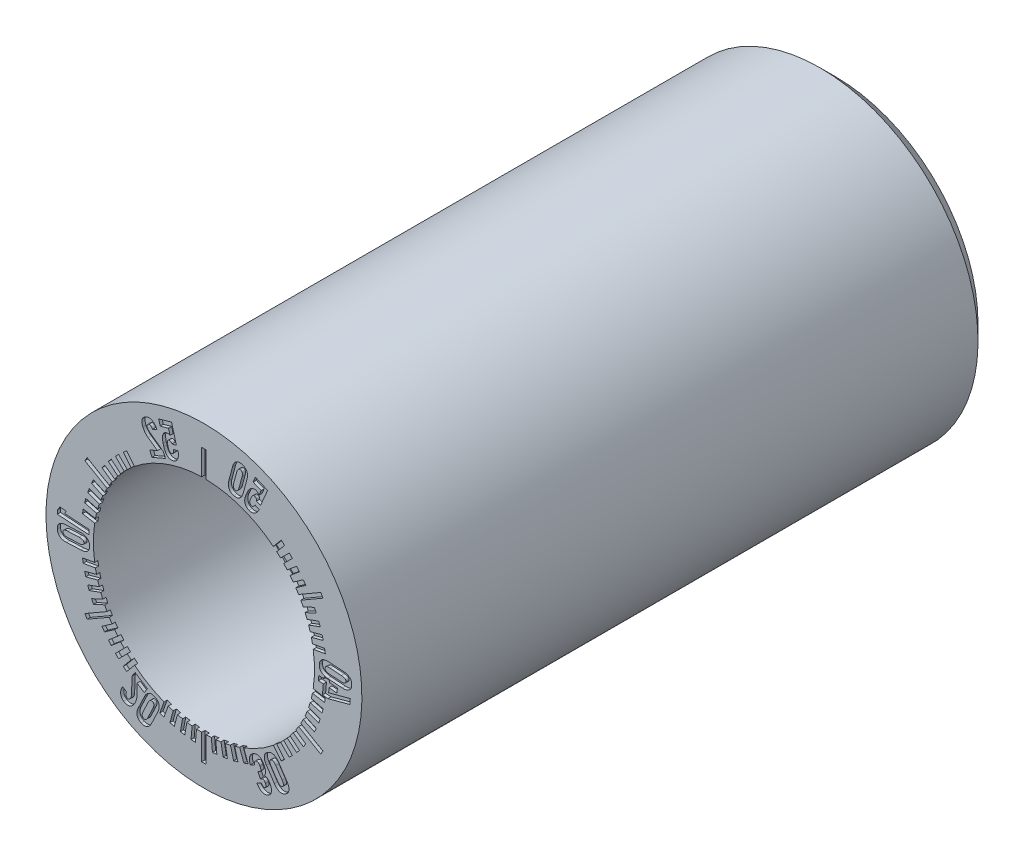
from build123d import *

# Parameters (mm, degrees)
CUT_EXTRUDE1_START = -0.1
CUT_EXTRUDE1_DEPTH = 0.1


with BuildPart() as part:
    # Sketch1 → Revolve1 (revolve)
    with BuildSketch(Plane(origin=(0, 0, 0), x_dir=(0, 0, -1), z_dir=(1, 0, 0))):
        Polygon((20, 2.5), (20, 4.5), (19.5, 5), (0, 5), (0, 3.5), (5, 3.5), (5, 1.25), (15, 1.25), (15, 2.5), align=None)
    revolve(axis=Axis((0, 0, 0), (0, 0, 1)))

    # Sketch2 → Cut-Extrude1 (cut)
    # profile 1 of 58: a face of its own
    with BuildSketch(Plane.XY.offset(CUT_EXTRUDE1_START)):
        with BuildLine():
            add(Edge.make_bspline(
                [(-0.963398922, 3.491967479), (-0.943691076, 3.497097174), (-0.915713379, 3.509662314), (-0.883270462, 3.534044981), (-0.862017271, 3.556028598), (-0.84399068, 3.581643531), (-0.829628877, 3.610634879), (-0.818540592, 3.642732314), (-0.811073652, 3.677865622), (-0.80742026, 3.715678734), (-0.807382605, 3.770861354), (-0.81426484, 3.812949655), (-0.820176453, 3.841421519)],
                knots=[0, 0, 0, 0, 0.145415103, 0.216818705, 0.289347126, 0.363340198, 0.440075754, 0.520124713, 0.605777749, 0.69649618, 0.791544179, 1, 1, 1, 1], degree=3))
            Line((-0.820176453, 3.841421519), (-0.820314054, 3.842051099))
            Line((-0.820314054, 3.842051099), (-0.963362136, 3.802672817))
            Line((-0.963362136, 3.802672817), (-0.963224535, 3.802043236))
            add(Edge.make_bspline(
                [(-0.963224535, 3.802043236), (-0.960278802, 3.785789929), (-0.957663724, 3.762083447), (-0.96042298, 3.731942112), (-0.965318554, 3.712849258), (-0.973504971, 3.696624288), (-0.987741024, 3.678657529), (-1.003244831, 3.670670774), (-1.013951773, 3.66773284)],
                knots=[0, 0, 0, 0, 0.313109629, 0.447280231, 0.570879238, 0.68353828, 0.788831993, 1, 1, 1, 1], degree=3))
            add(Edge.make_bspline(
                [(-1.013951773, 3.66773284), (-1.025414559, 3.664684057), (-1.043855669, 3.66312308), (-1.0664287, 3.671751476), (-1.08168352, 3.682670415), (-1.095456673, 3.697700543), (-1.112531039, 3.724626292), (-1.120931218, 3.748455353), (-1.125660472, 3.765353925)],
                knots=[0, 0, 0, 0, 0.215343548, 0.318808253, 0.428769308, 0.550080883, 0.683403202, 1, 1, 1, 1], degree=3))
            Line((-1.125660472, 3.765353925), (-1.147851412, 3.846061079))
            add(Edge.make_bspline(
                [(-1.147851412, 3.846061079), (-1.152266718, 3.863008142), (-1.157742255, 3.887527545), (-1.157406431, 3.919028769), (-1.154224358, 3.938502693), (-1.1477516, 3.955115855), (-1.135004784, 3.973214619), (-1.120176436, 3.981163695), (-1.109903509, 3.983911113)],
                knots=[0, 0, 0, 0, 0.330370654, 0.46673551, 0.589796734, 0.699046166, 0.799089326, 1, 1, 1, 1], degree=3))
            add(Edge.make_bspline(
                [(-1.109903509, 3.983911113), (-1.100274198, 3.986514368), (-1.085153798, 3.988413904), (-1.06550986, 3.984596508), (-1.051596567, 3.978891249), (-1.038531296, 3.970619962), (-1.022216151, 3.955545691), (-1.012224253, 3.941581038), (-1.00670531, 3.93126545)],
                knots=[0, 0, 0, 0, 0.238363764, 0.355275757, 0.473080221, 0.594658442, 0.721599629, 1, 1, 1, 1], degree=3))
            Line((-1.00670531, 3.93126545), (-0.872963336, 3.967950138))
            Line((-0.872963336, 3.967950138), (-1.025193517, 4.521705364))
            Line((-1.025193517, 4.521705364), (-1.43303211, 4.409612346))
            Line((-1.43303211, 4.409612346), (-1.384922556, 4.23476422))
            Line((-1.384922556, 4.23476422), (-1.120236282, 4.307654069))
            Line((-1.120236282, 4.307654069), (-1.073369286, 4.137283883))
            add(Edge.make_bspline(
                [(-1.073369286, 4.137283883), (-1.08092465, 4.142295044), (-1.093159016, 4.149210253), (-1.111486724, 4.154129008), (-1.140619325, 4.159596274), (-1.166028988, 4.158089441), (-1.185189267, 4.153017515)],
                knots=[0, 0, 0, 0, 0.235051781, 0.357896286, 0.488415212, 1, 1, 1, 1], degree=3))
            add(Edge.make_bspline(
                [(-1.185189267, 4.153017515), (-1.203816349, 4.148195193), (-1.230023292, 4.136280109), (-1.259350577, 4.112422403), (-1.277445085, 4.090983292), (-1.292213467, 4.06610587), (-1.30288085, 4.037727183), (-1.310243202, 4.006204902), (-1.313562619, 3.971523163), (-1.313489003, 3.933980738), (-1.308120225, 3.87822992), (-1.299073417, 3.835605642), (-1.290899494, 3.806682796)],
                knots=[0, 0, 0, 0, 0.141925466, 0.209430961, 0.277840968, 0.348141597, 0.422141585, 0.500944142, 0.586672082, 0.678948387, 0.777953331, 1, 1, 1, 1], degree=3))
            Line((-1.290899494, 3.806682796), (-1.268708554, 3.725975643))
            add(Edge.make_bspline(
                [(-1.268708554, 3.725975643), (-1.260782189, 3.696989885), (-1.2465533, 3.65563087), (-1.220647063, 3.605576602), (-1.199494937, 3.57384782), (-1.176201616, 3.546482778), (-1.15089635, 3.523855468), (-1.123682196, 3.505730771), (-1.094380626, 3.49284974), (-1.06352741, 3.48459686), (-1.019249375, 3.48082902), (-0.98555523, 3.485777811), (-0.963398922, 3.491967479)],
                knots=[0, 0, 0, 0, 0.207498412, 0.300462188, 0.388251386, 0.470100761, 0.547790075, 0.621801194, 0.694771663, 0.767701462, 0.841218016, 1, 1, 1, 1], degree=3))
        make_face()
    # profile 2 of 58: a face of its own
    with BuildSketch(Plane.XY.offset(CUT_EXTRUDE1_START)):
        with BuildLine():
            Line((-1.217541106, 3.431346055), (-1.284083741, 3.587083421))
            Line((-1.284083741, 3.587083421), (-1.70882716, 3.895073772))
            add(Edge.make_bspline(
                [(-1.70882716, 3.895073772), (-1.727229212, 3.908553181), (-1.759251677, 3.937516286), (-1.783909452, 3.973123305), (-1.791751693, 3.991772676)],
                knots=[0, 0, 0, 0, 0.531264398, 1, 1, 1, 1], degree=3))
            Line((-1.791751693, 3.991772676), (-1.79235425, 3.992912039))
            add(Edge.make_bspline(
                [(-1.79235425, 3.992912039), (-1.797064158, 4.004037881), (-1.802294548, 4.0211074), (-1.801901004, 4.043773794), (-1.798337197, 4.058817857), (-1.791406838, 4.072298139), (-1.777643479, 4.088822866), (-1.762994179, 4.097075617), (-1.75274653, 4.101631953)],
                knots=[0, 0, 0, 0, 0.277150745, 0.39895692, 0.513565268, 0.626865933, 0.741851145, 1, 1, 1, 1], degree=3))
            add(Edge.make_bspline(
                [(-1.75274653, 4.101631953), (-1.742282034, 4.106409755), (-1.724851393, 4.109416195), (-1.701907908, 4.104885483), (-1.685098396, 4.097279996), (-1.66914391, 4.085397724), (-1.647678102, 4.063381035), (-1.634656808, 4.04286721), (-1.62667354, 4.027970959)],
                knots=[0, 0, 0, 0, 0.212932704, 0.317957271, 0.430528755, 0.552792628, 0.685363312, 1, 1, 1, 1], degree=3))
            Line((-1.62667354, 4.027970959), (-1.626372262, 4.027401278))
            Line((-1.626372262, 4.027401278), (-1.486618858, 4.086948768))
            Line((-1.486618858, 4.086948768), (-1.486920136, 4.087518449))
            add(Edge.make_bspline(
                [(-1.486920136, 4.087518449), (-1.499480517, 4.113880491), (-1.521349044, 4.150456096), (-1.555013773, 4.194137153), (-1.581579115, 4.221174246), (-1.609292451, 4.243835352), (-1.637969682, 4.262096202), (-1.667677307, 4.27547321), (-1.698254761, 4.283960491), (-1.729356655, 4.287593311), (-1.771845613, 4.286068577), (-1.802993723, 4.277174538), (-1.822862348, 4.268674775)],
                knots=[0, 0, 0, 0, 0.205728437, 0.299640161, 0.38832332, 0.472436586, 0.551647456, 0.627417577, 0.701370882, 0.774580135, 0.84742633, 1, 1, 1, 1], degree=3))
            add(Edge.make_bspline(
                [(-1.822862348, 4.268674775), (-1.843974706, 4.2598494), (-1.873445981, 4.243491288), (-1.906685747, 4.215059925), (-1.926937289, 4.191852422), (-1.94313093, 4.166392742), (-1.954889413, 4.138748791), (-1.96235234, 4.109163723), (-1.965207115, 4.07771616), (-1.964109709, 4.044681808), (-1.956736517, 3.997039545), (-1.944448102, 3.96172232), (-1.934524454, 3.938210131)],
                knots=[0, 0, 0, 0, 0.173330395, 0.252926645, 0.330174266, 0.405738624, 0.480457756, 0.556707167, 0.635844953, 0.718783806, 0.806449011, 1, 1, 1, 1], degree=3))
            Line((-1.934524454, 3.938210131), (-1.934223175, 3.937640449))
            add(Edge.make_bspline(
                [(-1.934223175, 3.937640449), (-1.925163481, 3.916940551), (-1.910048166, 3.886373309), (-1.884959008, 3.848385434), (-1.864470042, 3.820883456), (-1.842359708, 3.795043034), (-1.811705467, 3.763307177), (-1.786321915, 3.742549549), (-1.768768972, 3.729963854)],
                knots=[0, 0, 0, 0, 0.252454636, 0.379386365, 0.507804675, 0.635109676, 0.758810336, 1, 1, 1, 1], degree=3))
            Line((-1.768768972, 3.729963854), (-1.46908914, 3.520881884))
            Line((-1.46908914, 3.520881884), (-1.716333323, 3.415495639))
            Line((-1.716333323, 3.415495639), (-1.645218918, 3.248908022))
            Line((-1.645218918, 3.248908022), (-1.217541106, 3.431346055))
        make_face()
    # profile 3 of 58: a face of its own
    with BuildSketch(Plane.XY.offset(CUT_EXTRUDE1_START)):
        with BuildLine():
            Line((0.906376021, 4.269673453), (0.788776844, 3.831770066))
            add(Edge.make_bspline(
                [(0.788776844, 3.831770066), (0.78310185, 3.811321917), (0.776857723, 3.780912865), (0.772575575, 3.740833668), (0.771830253, 3.712885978), (0.773679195, 3.686257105), (0.777631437, 3.660962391), (0.783810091, 3.636929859), (0.792260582, 3.614237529), (0.803332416, 3.59320405), (0.816312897, 3.573686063), (0.831768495, 3.556189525), (0.849634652, 3.540698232), (0.86948871, 3.526725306), (0.90003518, 3.510512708), (0.925021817, 3.501653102), (0.942441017, 3.496986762)],
                knots=[0, 0, 0, 0, 0.152012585, 0.221947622, 0.288611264, 0.352064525, 0.412958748, 0.471817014, 0.529594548, 0.586042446, 0.641774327, 0.697188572, 0.752748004, 0.810877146, 0.870780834, 1, 1, 1, 1], degree=3))
            add(Edge.make_bspline(
                [(0.942441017, 3.496986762), (0.959956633, 3.49229876), (0.986141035, 3.48713971), (1.020810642, 3.486263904), (1.045098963, 3.488089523), (1.068367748, 3.492917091), (1.090487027, 3.500461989), (1.111667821, 3.510557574), (1.131604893, 3.523486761), (1.15023566, 3.539080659), (1.167846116, 3.55666284), (1.183938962, 3.57671133), (1.198394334, 3.599084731), (1.211842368, 3.623413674), (1.228426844, 3.659827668), (1.237704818, 3.689216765), (1.243280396, 3.709480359)],
                knots=[0, 0, 0, 0, 0.130125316, 0.190042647, 0.248117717, 0.304319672, 0.359876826, 0.415243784, 0.472074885, 0.529686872, 0.589087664, 0.650164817, 0.713550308, 0.779781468, 0.849252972, 1, 1, 1, 1], degree=3))
            Line((1.243280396, 3.709480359), (1.360879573, 4.147383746))
            add(Edge.make_bspline(
                [(1.360879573, 4.147383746), (1.366562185, 4.167832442), (1.372784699, 4.198239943), (1.377099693, 4.238321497), (1.377759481, 4.266225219), (1.376212, 4.292837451), (1.372170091, 4.318082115), (1.36609377, 4.342101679), (1.357398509, 4.364657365), (1.346407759, 4.385671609), (1.333427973, 4.405205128), (1.317856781, 4.422681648), (1.300228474, 4.438476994), (1.280037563, 4.452089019), (1.249815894, 4.468844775), (1.224563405, 4.477379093), (1.2072154, 4.482167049)],
                knots=[0, 0, 0, 0, 0.152021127, 0.221960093, 0.28862748, 0.351812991, 0.412710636, 0.471572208, 0.529046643, 0.585497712, 0.641232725, 0.696650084, 0.752785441, 0.810393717, 0.870773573, 1, 1, 1, 1], degree=3))
            add(Edge.make_bspline(
                [(1.2072154, 4.482167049), (1.189698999, 4.486859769), (1.163516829, 4.492005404), (1.12884381, 4.492901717), (1.104609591, 4.491025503), (1.081402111, 4.486418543), (1.059315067, 4.479056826), (1.038249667, 4.468961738), (1.018395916, 4.456128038), (0.999582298, 4.441021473), (0.982407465, 4.423252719), (0.966106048, 4.403579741), (0.951402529, 4.381323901), (0.938163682, 4.356704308), (0.921688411, 4.319805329), (0.912009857, 4.290207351), (0.906376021, 4.269673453)],
                knots=[0, 0, 0, 0, 0.130052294, 0.189936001, 0.247978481, 0.303825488, 0.358985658, 0.414321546, 0.470687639, 0.527982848, 0.586757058, 0.647395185, 0.710773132, 0.777466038, 0.847431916, 1, 1, 1, 1], degree=3))
        make_face()
        with BuildLine():
            Line((1.205416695, 4.139388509), (1.112703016, 3.794258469))
            add(Edge.make_bspline(
                [(1.112703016, 3.794258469), (1.107090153, 3.773534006), (1.097233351, 3.744676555), (1.078892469, 3.711103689), (1.064471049, 3.692307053), (1.048335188, 3.678217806), (1.023280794, 3.667401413), (1.002499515, 3.667995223), (0.98953412, 3.671834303)],
                knots=[0, 0, 0, 0, 0.330588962, 0.466458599, 0.586759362, 0.693541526, 0.792195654, 1, 1, 1, 1], degree=3))
            add(Edge.make_bspline(
                [(0.98953412, 3.671834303), (0.976337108, 3.67488688), (0.95800071, 3.684837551), (0.941836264, 3.706822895), (0.934934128, 3.727055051), (0.931917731, 3.750546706), (0.932341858, 3.788818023), (0.939343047, 3.818656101), (0.944489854, 3.8393844)],
                knots=[0, 0, 0, 0, 0.207947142, 0.307153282, 0.413252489, 0.533041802, 0.670171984, 1, 1, 1, 1], degree=3))
            Line((0.944489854, 3.8393844), (1.037203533, 4.18451444))
            add(Edge.make_bspline(
                [(1.037203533, 4.18451444), (1.04257628, 4.205329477), (1.052532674, 4.234243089), (1.070858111, 4.267835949), (1.085307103, 4.286630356), (1.101459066, 4.300629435), (1.126431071, 4.311824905), (1.147360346, 4.31059651), (1.16029853, 4.307217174)],
                knots=[0, 0, 0, 0, 0.330542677, 0.467341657, 0.586506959, 0.693198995, 0.792612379, 1, 1, 1, 1], degree=3))
            add(Edge.make_bspline(
                [(1.16029853, 4.307217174), (1.173161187, 4.3036982), (1.192094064, 4.294378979), (1.207801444, 4.271958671), (1.215026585, 4.25180674), (1.217993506, 4.228305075), (1.217334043, 4.190072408), (1.210908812, 4.160151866), (1.205416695, 4.139388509)],
                knots=[0, 0, 0, 0, 0.207474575, 0.307012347, 0.413818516, 0.53349813, 0.669079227, 1, 1, 1, 1], degree=3))
        make_face(mode=Mode.SUBTRACT)
    # profile 4 of 58: a face of its own
    with BuildSketch(Plane.XY.offset(CUT_EXTRUDE1_START)):
        with BuildLine():
            add(Edge.make_bspline(
                [(1.423479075, 3.331326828), (1.442064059, 3.323198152), (1.471533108, 3.315263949), (1.51190905, 3.31413571), (1.542067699, 3.318104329), (1.572043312, 3.326997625), (1.601470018, 3.340354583), (1.629915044, 3.358774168), (1.657726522, 3.381310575), (1.684005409, 3.40870423), (1.718108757, 3.451906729), (1.739447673, 3.488686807), (1.752234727, 3.514717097)],
                knots=[0, 0, 0, 0, 0.145510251, 0.216188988, 0.288744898, 0.362890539, 0.439836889, 0.519872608, 0.605471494, 0.69622534, 0.791727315, 1, 1, 1, 1], degree=3))
            Line((1.752234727, 3.514717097), (1.752395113, 3.515434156))
            Line((1.752395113, 3.515434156), (1.616351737, 3.573721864))
            Line((1.616351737, 3.573721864), (1.61619135, 3.573004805))
            add(Edge.make_bspline(
                [(1.61619135, 3.573004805), (1.608596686, 3.558386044), (1.595770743, 3.538390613), (1.575014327, 3.516376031), (1.559062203, 3.504818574), (1.542742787, 3.49683682), (1.520288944, 3.492415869), (1.503340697, 3.495369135), (1.493171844, 3.499975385)],
                knots=[0, 0, 0, 0, 0.312251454, 0.4475685, 0.571049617, 0.683855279, 0.789242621, 1, 1, 1, 1], degree=3))
            add(Edge.make_bspline(
                [(1.493171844, 3.499975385), (1.482132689, 3.5043996), (1.467185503, 3.514941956), (1.454729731, 3.53547829), (1.449669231, 3.553426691), (1.448210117, 3.573679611), (1.451733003, 3.605221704), (1.459797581, 3.6290532), (1.466624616, 3.645147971)],
                knots=[0, 0, 0, 0, 0.215180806, 0.318297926, 0.428713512, 0.549185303, 0.683343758, 1, 1, 1, 1], degree=3))
            Line((1.466624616, 3.645147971), (1.499646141, 3.72209046))
            add(Edge.make_bspline(
                [(1.499646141, 3.72209046), (1.506712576, 3.738039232), (1.517751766, 3.760497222), (1.537503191, 3.78490344), (1.552144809, 3.798109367), (1.567621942, 3.80699413), (1.588818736, 3.813407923), (1.605406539, 3.810391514), (1.615134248, 3.80624507)],
                knots=[0, 0, 0, 0, 0.329508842, 0.466039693, 0.588877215, 0.698332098, 0.799555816, 1, 1, 1, 1], degree=3))
            add(Edge.make_bspline(
                [(1.615134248, 3.80624507), (1.624473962, 3.802511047), (1.637030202, 3.794087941), (1.650022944, 3.778963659), (1.657339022, 3.765892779), (1.662331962, 3.75136947), (1.666100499, 3.72952273), (1.664563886, 3.712354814), (1.662617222, 3.70081278)],
                knots=[0, 0, 0, 0, 0.239137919, 0.354459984, 0.473242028, 0.594435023, 0.719472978, 1, 1, 1, 1], degree=3))
            Line((1.662617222, 3.70081278), (1.789666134, 3.646332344))
            Line((1.789666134, 3.646332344), (2.01535628, 4.17294585))
            Line((2.01535628, 4.17294585), (1.627641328, 4.339130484))
            Line((1.627641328, 4.339130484), (1.556419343, 4.172966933))
            Line((1.556419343, 4.172966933), (1.808090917, 4.065070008))
            Line((1.808090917, 4.065070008), (1.73868911, 3.902901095))
            add(Edge.make_bspline(
                [(1.73868911, 3.902901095), (1.736301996, 3.911673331), (1.730592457, 3.92438938), (1.719790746, 3.939973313), (1.709815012, 3.951149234), (1.698690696, 3.961526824), (1.683377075, 3.974023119), (1.67028718, 3.9808266), (1.661556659, 3.984789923)],
                knots=[0, 0, 0, 0, 0.234742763, 0.357588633, 0.489557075, 0.621607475, 0.751152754, 1, 1, 1, 1], degree=3))
            add(Edge.make_bspline(
                [(1.661556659, 3.984789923), (1.643921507, 3.992461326), (1.616081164, 3.999793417), (1.578292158, 3.999340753), (1.55087285, 3.993730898), (1.523999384, 3.983383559), (1.497921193, 3.968043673), (1.472853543, 3.947717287), (1.44851478, 3.922855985), (1.425101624, 3.893609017), (1.39452114, 3.846873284), (1.375548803, 3.807788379), (1.363602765, 3.780378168)],
                knots=[0, 0, 0, 0, 0.14245609, 0.209736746, 0.278264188, 0.348619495, 0.422077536, 0.501376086, 0.586938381, 0.679293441, 0.778390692, 1, 1, 1, 1], degree=3))
            Line((1.363602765, 3.780378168), (1.330581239, 3.703435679))
            add(Edge.make_bspline(
                [(1.330581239, 3.703435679), (1.318727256, 3.675953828), (1.304094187, 3.634804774), (1.293367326, 3.579647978), (1.289783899, 3.54168732), (1.291145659, 3.505916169), (1.296602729, 3.4724583), (1.306741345, 3.441485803), (1.321514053, 3.413210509), (1.340673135, 3.387813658), (1.372720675, 3.357193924), (1.402427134, 3.340419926), (1.423479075, 3.331326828)],
                knots=[0, 0, 0, 0, 0.207204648, 0.300560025, 0.388130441, 0.470353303, 0.547509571, 0.621916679, 0.694790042, 0.767181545, 0.841030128, 1, 1, 1, 1], degree=3))
        make_face()
    # profile 5 of 58: a face of its own
    with BuildSketch(Plane.XY.offset(CUT_EXTRUDE1_START)):
        with BuildLine():
            ThreePointArc((-2.302929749, 2.635624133), (-2.249756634, 2.681155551), (-2.195683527, 2.725614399))
            Line((-2.195683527, 2.725614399), (-2.446820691, 3.024908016))
            Line((-2.446820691, 3.024908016), (-2.554066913, 2.934917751))
            Line((-2.554066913, 2.934917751), (-2.302929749, 2.635624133))
        make_face()
    # profile 6 of 58: a face of its own
    with BuildSketch(Plane.XY.offset(CUT_EXTRUDE1_START)):
        with BuildLine():
            ThreePointArc((-2.523876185, 2.424881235), (-2.474873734, 2.474873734), (-2.424881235, 2.523876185))
            Line((-2.424881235, 2.523876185), (-2.701147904, 2.800142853))
            Line((-2.701147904, 2.800142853), (-2.800142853, 2.701147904))
            Line((-2.800142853, 2.701147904), (-2.523876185, 2.424881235))
        make_face()
    # profile 7 of 58: a face of its own
    with BuildSketch(Plane.XY.offset(CUT_EXTRUDE1_START)):
        with BuildLine():
            ThreePointArc((-2.725614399, 2.195683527), (-2.681155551, 2.249756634), (-2.635624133, 2.302929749))
            Line((-2.635624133, 2.302929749), (-2.934917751, 2.554066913))
            Line((-2.934917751, 2.554066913), (-3.024908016, 2.446820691))
            Line((-3.024908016, 2.446820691), (-2.725614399, 2.195683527))
        make_face()
    # profile 8 of 58: a face of its own
    with BuildSketch(Plane.XY.offset(CUT_EXTRUDE1_START)):
        with BuildLine():
            ThreePointArc((-2.906609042, 1.94977534), (-2.867032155, 2.007517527), (-2.826308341, 2.064456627))
            Line((-2.826308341, 2.064456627), (-3.146351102, 2.288552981))
            Line((-3.146351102, 2.288552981), (-3.226651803, 2.173871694))
            Line((-3.226651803, 2.173871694), (-2.906609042, 1.94977534))
        make_face()
    # profile 9 of 58: a face of its own
    with BuildSketch(Plane.XY.offset(CUT_EXTRUDE1_START)):
        with BuildLine():
            ThreePointArc((-3.065482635, 1.689028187), (-3.031088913, 1.75), (-2.995482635, 1.810271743))
            Line((-2.995482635, 1.810271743), (-3.69756949, 2.215621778))
            Line((-3.69756949, 2.215621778), (-3.76756949, 2.094378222))
            Line((-3.76756949, 2.094378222), (-3.065482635, 1.689028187))
        make_face()
    # profile 10 of 58: a face of its own
    with BuildSketch(Plane.XY.offset(CUT_EXTRUDE1_START)):
        with BuildLine():
            ThreePointArc((-3.312207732, 1.13105258), (-3.288924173, 1.197070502), (-3.264324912, 1.262609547))
            Line((-3.264324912, 1.262609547), (-3.631462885, 1.396236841))
            Line((-3.631462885, 1.396236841), (-3.679345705, 1.264679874))
            Line((-3.679345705, 1.264679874), (-3.312207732, 1.13105258))
        make_face()
    # profile 11 of 58: a face of its own
    with BuildSketch(Plane.XY.offset(CUT_EXTRUDE1_START)):
        with BuildLine():
            ThreePointArc((-3.398181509, 0.838070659), (-3.380740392, 0.905866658), (-3.361946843, 0.973300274))
            Line((-3.361946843, 0.973300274), (-3.739334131, 1.074420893))
            Line((-3.739334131, 1.074420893), (-3.775568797, 0.939191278))
            Line((-3.775568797, 0.939191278), (-3.398181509, 0.838070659))
        make_face()
    # profile 12 of 58: a face of its own
    with BuildSketch(Plane.XY.offset(CUT_EXTRUDE1_START)):
        Polygon((-4.631555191, 0.318225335), (-4.639555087, 0.191470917), (-3.639547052, 0.128627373), (-3.630255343, 0.276992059), (-4.408929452, 0.326051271), (-4.356536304, 0.418851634), (-4.556866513, 0.431420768), align=None)
    # profile 13 of 58: a face of its own
    with BuildSketch(Plane.XY.offset(CUT_EXTRUDE1_START)):
        with BuildLine():
            Line((-4.345880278, -0.434022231), (-3.891213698, -0.413454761))
            add(Edge.make_bspline(
                [(-3.891213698, -0.413454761), (-3.869977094, -0.412500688), (-3.838941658, -0.409632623), (-3.799425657, -0.401139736), (-3.772423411, -0.393644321), (-3.74766626, -0.383531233), (-3.724500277, -0.372463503), (-3.703617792, -0.35893529), (-3.684594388, -0.34395548), (-3.667812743, -0.327162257), (-3.653148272, -0.30886908), (-3.641255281, -0.288654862), (-3.631402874, -0.267056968), (-3.624416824, -0.243723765), (-3.617896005, -0.209763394), (-3.61719924, -0.183159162), (-3.617948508, -0.165086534)],
                knots=[0, 0, 0, 0, 0.152120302, 0.22206649, 0.288842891, 0.352161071, 0.413047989, 0.472137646, 0.529661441, 0.585880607, 0.641536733, 0.696816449, 0.753146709, 0.810873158, 0.870519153, 1, 1, 1, 1], degree=3))
            add(Edge.make_bspline(
                [(-3.617948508, -0.165086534), (-3.618439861, -0.146879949), (-3.622218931, -0.120450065), (-3.631378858, -0.086936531), (-3.641014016, -0.064488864), (-3.652457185, -0.043684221), (-3.666346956, -0.024657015), (-3.682786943, -0.007749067), (-3.701189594, 0.007497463), (-3.721785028, 0.020456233), (-3.743973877, 0.03189322), (-3.76799395, 0.041044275), (-3.793633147, 0.048423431), (-3.821036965, 0.053669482), (-3.860933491, 0.057967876), (-3.89181822, 0.058543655), (-3.912855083, 0.057484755)],
                knots=[0, 0, 0, 0, 0.129909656, 0.190188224, 0.24777055, 0.304069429, 0.35960947, 0.415570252, 0.472219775, 0.530006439, 0.589141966, 0.650375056, 0.71340099, 0.779627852, 0.849521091, 1, 1, 1, 1], degree=3))
            Line((-3.912855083, 0.057484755), (-4.367521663, 0.036917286))
            add(Edge.make_bspline(
                [(-4.367521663, 0.036917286), (-4.388776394, 0.036025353), (-4.419827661, 0.032974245), (-4.459434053, 0.02473753), (-4.48632671, 0.016696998), (-4.511274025, 0.007105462), (-4.534460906, -0.004177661), (-4.555501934, -0.017563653), (-4.574517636, -0.032646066), (-4.591420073, -0.049344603), (-4.605671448, -0.067959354), (-4.617729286, -0.088031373), (-4.627257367, -0.109746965), (-4.634318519, -0.133007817), (-4.640807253, -0.166983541), (-4.64152497, -0.193577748), (-4.640768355, -0.211653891)],
                knots=[0, 0, 0, 0, 0.15202208, 0.222405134, 0.28875601, 0.352363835, 0.413211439, 0.472694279, 0.530180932, 0.586363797, 0.642005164, 0.697249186, 0.753306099, 0.810995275, 0.870602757, 1, 1, 1, 1], degree=3))
            add(Edge.make_bspline(
                [(-4.640768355, -0.211653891), (-4.640220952, -0.229836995), (-4.636600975, -0.256333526), (-4.627208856, -0.289706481), (-4.618229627, -0.312384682), (-4.60660811, -0.333021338), (-4.593057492, -0.352057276), (-4.576903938, -0.368947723), (-4.558764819, -0.384130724), (-4.538346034, -0.397188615), (-4.516218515, -0.408490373), (-4.492267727, -0.417824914), (-4.466512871, -0.425072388), (-4.438915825, -0.430318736), (-4.39854485, -0.434627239), (-4.367251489, -0.435062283), (-4.345880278, -0.434022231)],
                knots=[0, 0, 0, 0, 0.129763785, 0.189974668, 0.247205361, 0.303441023, 0.358670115, 0.413585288, 0.469827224, 0.527166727, 0.586235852, 0.646966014, 0.710373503, 0.776991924, 0.847281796, 1, 1, 1, 1], degree=3))
        make_face()
        with BuildLine():
            Line((-4.312653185, -0.109307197), (-3.954388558, -0.09302424))
            add(Edge.make_bspline(
                [(-3.954388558, -0.09302424), (-3.932863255, -0.092139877), (-3.902162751, -0.092327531), (-3.864493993, -0.099846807), (-3.842073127, -0.107838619), (-3.823768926, -0.119180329), (-3.805351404, -0.139572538), (-3.799865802, -0.159949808), (-3.799516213, -0.173449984)],
                knots=[0, 0, 0, 0, 0.330392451, 0.466190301, 0.586133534, 0.692793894, 0.792371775, 1, 1, 1, 1], degree=3))
            add(Edge.make_bspline(
                [(-3.799516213, -0.173449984), (-3.799149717, -0.186700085), (-3.801915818, -0.20772898), (-3.81885023, -0.229224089), (-3.835907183, -0.242111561), (-3.857402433, -0.252324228), (-3.89432987, -0.262864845), (-3.924745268, -0.26630807), (-3.946285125, -0.267248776)],
                knots=[0, 0, 0, 0, 0.207162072, 0.306024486, 0.412429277, 0.53284017, 0.668983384, 1, 1, 1, 1], degree=3))
            Line((-3.946285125, -0.267248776), (-4.304549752, -0.283531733))
            add(Edge.make_bspline(
                [(-4.304549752, -0.283531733), (-4.326076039, -0.284417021), (-4.356773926, -0.284226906), (-4.394446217, -0.276710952), (-4.416859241, -0.268711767), (-4.435106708, -0.257443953), (-4.453333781, -0.237109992), (-4.458823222, -0.216934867), (-4.459182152, -0.20349339)],
                knots=[0, 0, 0, 0, 0.331217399, 0.46735432, 0.587597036, 0.694523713, 0.792892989, 1, 1, 1, 1], degree=3))
            add(Edge.make_bspline(
                [(-4.459182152, -0.20349339), (-4.459860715, -0.190078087), (-4.456416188, -0.169414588), (-4.440265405, -0.147270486), (-4.422989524, -0.134474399), (-4.401549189, -0.124222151), (-4.364597, -0.113699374), (-4.334199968, -0.110242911), (-4.312653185, -0.109307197)],
                knots=[0, 0, 0, 0, 0.207046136, 0.306674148, 0.412979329, 0.533277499, 0.669293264, 1, 1, 1, 1], degree=3))
        make_face(mode=Mode.SUBTRACT)
    # profile 14 of 58: a face of its own
    with BuildSketch(Plane.XY.offset(CUT_EXTRUDE1_START)):
        with BuildLine():
            ThreePointArc((-3.433982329, -0.676583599), (-3.446827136, -0.607768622), (-3.458293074, -0.538710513))
            Line((-3.458293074, -0.538710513), (-3.843057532, -0.606554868))
            Line((-3.843057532, -0.606554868), (-3.818746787, -0.744427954))
            Line((-3.818746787, -0.744427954), (-3.433982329, -0.676583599))
        make_face()
    # profile 15 of 58: a face of its own
    with BuildSketch(Plane.XY.offset(CUT_EXTRUDE1_START)):
        with BuildLine():
            ThreePointArc((-3.361946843, -0.973300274), (-3.380740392, -0.905866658), (-3.398181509, -0.838070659))
            Line((-3.398181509, -0.838070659), (-3.775568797, -0.939191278))
            Line((-3.775568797, -0.939191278), (-3.739334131, -1.074420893))
            Line((-3.739334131, -1.074420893), (-3.361946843, -0.973300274))
        make_face()
    # profile 16 of 58: a face of its own
    with BuildSketch(Plane.XY.offset(CUT_EXTRUDE1_START)):
        with BuildLine():
            ThreePointArc((-3.264324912, -1.262609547), (-3.288924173, -1.197070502), (-3.312207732, -1.13105258))
            Line((-3.312207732, -1.13105258), (-3.679345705, -1.264679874))
            Line((-3.679345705, -1.264679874), (-3.631462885, -1.396236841))
            Line((-3.631462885, -1.396236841), (-3.264324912, -1.262609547))
        make_face()
    # profile 17 of 58: a face of its own
    with BuildSketch(Plane.XY.offset(CUT_EXTRUDE1_START)):
        with BuildLine():
            ThreePointArc((-3.141859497, -1.542309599), (-3.172077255, -1.479163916), (-3.201026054, -1.415426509))
            Line((-3.201026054, -1.415426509), (-3.55512057, -1.580543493))
            Line((-3.55512057, -1.580543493), (-3.495954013, -1.707426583))
            Line((-3.495954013, -1.707426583), (-3.141859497, -1.542309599))
        make_face()
    # profile 18 of 58: a face of its own
    with BuildSketch(Plane.XY.offset(CUT_EXTRUDE1_START)):
        with BuildLine():
            ThreePointArc((-2.995482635, -1.810271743), (-3.031088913, -1.75), (-3.065482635, -1.689028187))
            Line((-3.065482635, -1.689028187), (-3.76756949, -2.094378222))
            Line((-3.76756949, -2.094378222), (-3.69756949, -2.215621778))
            Line((-3.69756949, -2.215621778), (-2.995482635, -1.810271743))
        make_face()
    # profile 19 of 58: a face of its own
    with BuildSketch(Plane.XY.offset(CUT_EXTRUDE1_START)):
        with BuildLine():
            ThreePointArc((-2.826308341, -2.064456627), (-2.867032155, -2.007517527), (-2.906609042, -1.94977534))
            Line((-2.906609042, -1.94977534), (-3.226651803, -2.173871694))
            Line((-3.226651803, -2.173871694), (-3.146351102, -2.288552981))
            Line((-3.146351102, -2.288552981), (-2.826308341, -2.064456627))
        make_face()
    # profile 20 of 58: a face of its own
    with BuildSketch(Plane.XY.offset(CUT_EXTRUDE1_START)):
        with BuildLine():
            ThreePointArc((-2.635624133, -2.302929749), (-2.681155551, -2.249756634), (-2.725614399, -2.195683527))
            Line((-2.725614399, -2.195683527), (-3.024908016, -2.446820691))
            Line((-3.024908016, -2.446820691), (-2.934917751, -2.554066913))
            Line((-2.934917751, -2.554066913), (-2.635624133, -2.302929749))
        make_face()
    # profile 21 of 58: a face of its own
    with BuildSketch(Plane.XY.offset(CUT_EXTRUDE1_START)):
        with BuildLine():
            ThreePointArc((-2.424881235, -2.523876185), (-2.474873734, -2.474873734), (-2.523876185, -2.424881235))
            Line((-2.523876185, -2.424881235), (-2.800142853, -2.701147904))
            Line((-2.800142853, -2.701147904), (-2.701147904, -2.800142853))
            Line((-2.701147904, -2.800142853), (-2.424881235, -2.523876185))
        make_face()
    # profile 22 of 58: a face of its own
    with BuildSketch(Plane.XY.offset(CUT_EXTRUDE1_START)):
        with BuildLine():
            ThreePointArc((-2.195683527, -2.725614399), (-2.249756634, -2.681155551), (-2.302929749, -2.635624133))
            Line((-2.302929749, -2.635624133), (-2.554066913, -2.934917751))
            Line((-2.554066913, -2.934917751), (-2.446820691, -3.024908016))
            Line((-2.446820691, -3.024908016), (-2.195683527, -2.725614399))
        make_face()
    # profile 23 of 58: a face of its own
    with BuildSketch(Plane.XY.offset(CUT_EXTRUDE1_START)):
        with BuildLine():
            Line((-2.180530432, -2.915649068), (-2.273100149, -3.057384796))
            Line((-2.273100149, -3.057384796), (-2.29329267, -3.580988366))
            add(Edge.make_bspline(
                [(-2.29329267, -3.580988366), (-2.293713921, -3.603782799), (-2.300261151, -3.646460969), (-2.316499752, -3.68653088), (-2.327567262, -3.703437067)],
                knots=[0, 0, 0, 0, 0.530943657, 1, 1, 1, 1], degree=3))
            Line((-2.327567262, -3.703437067), (-2.32825557, -3.704405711))
            add(Edge.make_bspline(
                [(-2.32825557, -3.704405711), (-2.334822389, -3.714548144), (-2.346165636, -3.728036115), (-2.364847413, -3.740638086), (-2.379240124, -3.746070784), (-2.39429594, -3.747902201), (-2.415709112, -3.745356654), (-2.430873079, -3.738138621), (-2.440355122, -3.731893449)],
                knots=[0, 0, 0, 0, 0.27662202, 0.396327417, 0.511381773, 0.624843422, 0.739614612, 1, 1, 1, 1], degree=3))
            add(Edge.make_bspline(
                [(-2.440355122, -3.731893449), (-2.449776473, -3.7256606), (-2.462528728, -3.713318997), (-2.47100811, -3.691635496), (-2.474180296, -3.673514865), (-2.473269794, -3.653547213), (-2.467007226, -3.623358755), (-2.456960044, -3.601169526), (-2.449154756, -3.586254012)],
                knots=[0, 0, 0, 0, 0.21171391, 0.316611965, 0.428462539, 0.551661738, 0.685910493, 1, 1, 1, 1], degree=3))
            Line((-2.449154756, -3.586254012), (-2.448758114, -3.585635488))
            Line((-2.448758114, -3.585635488), (-2.575649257, -3.502585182))
            Line((-2.575649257, -3.502585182), (-2.576045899, -3.503203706))
            add(Edge.make_bspline(
                [(-2.576045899, -3.503203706), (-2.590408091, -3.528534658), (-2.609901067, -3.566576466), (-2.626745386, -3.619088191), (-2.634912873, -3.65604657), (-2.638280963, -3.691630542), (-2.637569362, -3.72553378), (-2.632091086, -3.757621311), (-2.62234994, -3.787766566), (-2.608120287, -3.815711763), (-2.582978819, -3.849996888), (-2.558403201, -3.871086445), (-2.540239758, -3.882837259)],
                knots=[0, 0, 0, 0, 0.20582646, 0.299887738, 0.388483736, 0.472377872, 0.551507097, 0.627071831, 0.701237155, 0.774222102, 0.84737213, 1, 1, 1, 1], degree=3))
            add(Edge.make_bspline(
                [(-2.540239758, -3.882837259), (-2.521097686, -3.895392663), (-2.491118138, -3.910878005), (-2.449050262, -3.922755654), (-2.418563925, -3.926833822), (-2.38843149, -3.925957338), (-2.358939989, -3.920459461), (-2.330220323, -3.910315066), (-2.302413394, -3.895527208), (-2.275508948, -3.876411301), (-2.240584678, -3.843349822), (-2.217603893, -3.814127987), (-2.203732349, -3.79271914)],
                knots=[0, 0, 0, 0, 0.173731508, 0.253549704, 0.330505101, 0.406082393, 0.48118763, 0.557131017, 0.636157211, 0.719312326, 0.806644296, 1, 1, 1, 1], degree=3))
            Line((-2.203732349, -3.79271914), (-2.203335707, -3.792100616))
            add(Edge.make_bspline(
                [(-2.203335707, -3.792100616), (-2.190986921, -3.773159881), (-2.174337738, -3.743360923), (-2.156371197, -3.701538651), (-2.1449336, -3.669202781), (-2.135883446, -3.636472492), (-2.126671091, -3.593399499), (-2.123455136, -3.560835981), (-2.122885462, -3.539324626)],
                knots=[0, 0, 0, 0, 0.252597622, 0.38040409, 0.508210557, 0.635524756, 0.75958, 1, 1, 1, 1], degree=3))
            Line((-2.122885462, -3.539324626), (-2.115362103, -3.174316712))
            Line((-2.115362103, -3.174316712), (-1.890627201, -3.321320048))
            Line((-1.890627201, -3.321320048), (-1.791629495, -3.16987462))
            Line((-1.791629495, -3.16987462), (-2.180530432, -2.915649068))
        make_face()
    # profile 24 of 58: a face of its own
    with BuildSketch(Plane.XY.offset(CUT_EXTRUDE1_START)):
        with BuildLine():
            Line((-1.65372834, -4.045159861), (-1.458160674, -3.632943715))
            add(Edge.make_bspline(
                [(-1.458160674, -3.632943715), (-1.448980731, -3.613731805), (-1.437145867, -3.584838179), (-1.425536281, -3.545959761), (-1.419946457, -3.51840786), (-1.416592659, -3.491854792), (-1.415893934, -3.46616073), (-1.417775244, -3.441283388), (-1.422020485, -3.417288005), (-1.428755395, -3.394405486), (-1.438455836, -3.372990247), (-1.450311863, -3.352755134), (-1.465197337, -3.334233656), (-1.482287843, -3.316872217), (-1.509245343, -3.295079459), (-1.532574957, -3.282114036), (-1.548856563, -3.274184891)],
                knots=[0, 0, 0, 0, 0.151857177, 0.222281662, 0.289103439, 0.35216156, 0.412969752, 0.472116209, 0.52981593, 0.586507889, 0.641754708, 0.697124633, 0.753340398, 0.810764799, 0.870633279, 1, 1, 1, 1], degree=3))
            add(Edge.make_bspline(
                [(-1.548856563, -3.274184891), (-1.565262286, -3.266310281), (-1.590320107, -3.256857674), (-1.624380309, -3.249535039), (-1.648742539, -3.247253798), (-1.672583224, -3.247747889), (-1.695837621, -3.25125989), (-1.718586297, -3.257589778), (-1.740509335, -3.266986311), (-1.761782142, -3.278848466), (-1.782152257, -3.293211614), (-1.801623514, -3.310027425), (-1.820233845, -3.329202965), (-1.837705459, -3.351063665), (-1.860451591, -3.384274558), (-1.875314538, -3.411479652), (-1.884331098, -3.430628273)],
                knots=[0, 0, 0, 0, 0.129827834, 0.19015874, 0.248081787, 0.304026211, 0.359886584, 0.415449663, 0.472043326, 0.529659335, 0.588953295, 0.649558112, 0.712987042, 0.77933948, 0.848981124, 1, 1, 1, 1], degree=3))
            Line((-1.884331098, -3.430628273), (-2.079898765, -3.84284442))
            add(Edge.make_bspline(
                [(-2.079898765, -3.84284442), (-2.089263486, -3.862024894), (-2.100709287, -3.891099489), (-2.112369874, -3.929891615), (-2.117996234, -3.957439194), (-2.12132573, -3.983994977), (-2.122045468, -4.009787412), (-2.120128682, -4.034653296), (-2.116007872, -4.058665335), (-2.108847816, -4.081388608), (-2.099651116, -4.103017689), (-2.087334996, -4.122908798), (-2.072900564, -4.141766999), (-2.055466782, -4.158828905), (-2.028582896, -4.180787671), (-2.005167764, -4.193675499), (-1.988916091, -4.201631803)],
                knots=[0, 0, 0, 0, 0.152076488, 0.222488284, 0.288616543, 0.352348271, 0.413145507, 0.472281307, 0.529970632, 0.586467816, 0.641834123, 0.697124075, 0.752855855, 0.810798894, 0.870656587, 1, 1, 1, 1], degree=3))
            add(Edge.make_bspline(
                [(-1.988916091, -4.201631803), (-1.972486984, -4.209301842), (-1.947600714, -4.219200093), (-1.913588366, -4.226344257), (-1.889355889, -4.228838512), (-1.865729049, -4.228432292), (-1.842652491, -4.225172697), (-1.820017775, -4.219169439), (-1.798057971, -4.210031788), (-1.776762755, -4.198415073), (-1.756397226, -4.18411383), (-1.737155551, -4.167033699), (-1.718380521, -4.147843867), (-1.700705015, -4.125855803), (-1.677926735, -4.092114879), (-1.662985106, -4.06452527), (-1.65372834, -4.045159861)],
                knots=[0, 0, 0, 0, 0.129443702, 0.189718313, 0.247243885, 0.302755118, 0.357733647, 0.412999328, 0.46921576, 0.526865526, 0.585621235, 0.646183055, 0.710033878, 0.776798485, 0.846975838, 1, 1, 1, 1], degree=3))
        make_face()
        with BuildLine():
            Line((-1.925076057, -3.863041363), (-1.770782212, -3.538092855))
            add(Edge.make_bspline(
                [(-1.770782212, -3.538092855), (-1.761778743, -3.518484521), (-1.746794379, -3.491677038), (-1.722546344, -3.461854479), (-1.704844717, -3.445890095), (-1.686272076, -3.435136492), (-1.659663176, -3.428374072), (-1.639100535, -3.433109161), (-1.626963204, -3.439025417)],
                knots=[0, 0, 0, 0, 0.330310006, 0.466873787, 0.586465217, 0.693088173, 0.792105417, 1, 1, 1, 1], degree=3))
            add(Edge.make_bspline(
                [(-1.626963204, -3.439025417), (-1.614655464, -3.444566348), (-1.598419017, -3.457620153), (-1.586341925, -3.482209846), (-1.583324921, -3.503497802), (-1.584443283, -3.527243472), (-1.592091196, -3.564926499), (-1.603595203, -3.593418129), (-1.612854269, -3.612904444)],
                knots=[0, 0, 0, 0, 0.20663118, 0.306093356, 0.412851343, 0.53229885, 0.669019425, 1, 1, 1, 1], degree=3))
            Line((-1.612854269, -3.612904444), (-1.767148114, -3.937852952))
            add(Edge.make_bspline(
                [(-1.767148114, -3.937852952), (-1.776546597, -3.957225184), (-1.791066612, -3.984320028), (-1.815438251, -4.014136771), (-1.833185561, -4.030147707), (-1.851815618, -4.040937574), (-1.878330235, -4.047684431), (-1.898792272, -4.04297338), (-1.910838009, -4.037078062)],
                knots=[0, 0, 0, 0, 0.330389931, 0.467025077, 0.587718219, 0.694396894, 0.793465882, 1, 1, 1, 1], degree=3))
            add(Edge.make_bspline(
                [(-1.910838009, -4.037078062), (-1.922888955, -4.031244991), (-1.939921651, -4.018658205), (-1.951434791, -3.993726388), (-1.954866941, -3.972477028), (-1.953641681, -3.94866465), (-1.945693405, -3.911018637), (-1.934413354, -3.882503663), (-1.925076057, -3.863041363)],
                knots=[0, 0, 0, 0, 0.207349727, 0.306898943, 0.412975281, 0.533700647, 0.669542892, 1, 1, 1, 1], degree=3))
        make_face(mode=Mode.SUBTRACT)
    # profile 25 of 58: a face of its own
    with BuildSketch(Plane.XY.offset(CUT_EXTRUDE1_START)):
        with BuildLine():
            ThreePointArc((-1.13105258, -3.312207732), (-1.197070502, -3.288924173), (-1.262609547, -3.264324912))
            Line((-1.262609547, -3.264324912), (-1.396236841, -3.631462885))
            Line((-1.396236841, -3.631462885), (-1.264679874, -3.679345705))
            Line((-1.264679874, -3.679345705), (-1.13105258, -3.312207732))
        make_face()
    # profile 26 of 58: a face of its own
    with BuildSketch(Plane.XY.offset(CUT_EXTRUDE1_START)):
        with BuildLine():
            ThreePointArc((-0.838070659, -3.398181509), (-0.905866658, -3.380740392), (-0.973300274, -3.361946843))
            Line((-0.973300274, -3.361946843), (-1.074420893, -3.739334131))
            Line((-1.074420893, -3.739334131), (-0.939191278, -3.775568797))
            Line((-0.939191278, -3.775568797), (-0.838070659, -3.398181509))
        make_face()
    # profile 27 of 58: a face of its own
    with BuildSketch(Plane.XY.offset(CUT_EXTRUDE1_START)):
        with BuildLine():
            ThreePointArc((-0.538710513, -3.458293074), (-0.607768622, -3.446827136), (-0.676583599, -3.433982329))
            Line((-0.676583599, -3.433982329), (-0.744427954, -3.818746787))
            Line((-0.744427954, -3.818746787), (-0.606554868, -3.843057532))
            Line((-0.606554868, -3.843057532), (-0.538710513, -3.458293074))
        make_face()
    # profile 28 of 58: a face of its own
    with BuildSketch(Plane.XY.offset(CUT_EXTRUDE1_START)):
        with BuildLine():
            ThreePointArc((-0.235250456, -3.492084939), (-0.3050451, -3.486681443), (-0.374717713, -3.479883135))
            Line((-0.374717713, -3.479883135), (-0.408769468, -3.869096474))
            Line((-0.408769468, -3.869096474), (-0.26930221, -3.881298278))
            Line((-0.26930221, -3.881298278), (-0.235250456, -3.492084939))
        make_face()
    # profile 29 of 58: a face of its own
    with BuildSketch(Plane.XY.offset(CUT_EXTRUDE1_START)):
        with BuildLine():
            ThreePointArc((0.07, -3.49929993), (0, -3.5), (-0.07, -3.49929993))
            Line((-0.07, -3.49929993), (-0.07, -4.31))
            Line((-0.07, -4.31), (0.07, -4.31))
            Line((0.07, -4.31), (0.07, -3.49929993))
        make_face()
    # profile 30 of 58: a face of its own
    with BuildSketch(Plane.XY.offset(CUT_EXTRUDE1_START)):
        with BuildLine():
            Line((0.408769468, -3.869096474), (0.374717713, -3.479883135))
            ThreePointArc((0.374717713, -3.479883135), (0.3050451, -3.486681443), (0.235250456, -3.492084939))
            Line((0.235250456, -3.492084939), (0.26930221, -3.881298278))
            Line((0.26930221, -3.881298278), (0.408769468, -3.869096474))
        make_face()
    # profile 31 of 58: a face of its own
    with BuildSketch(Plane.XY.offset(CUT_EXTRUDE1_START)):
        with BuildLine():
            Line((0.744427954, -3.818746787), (0.676583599, -3.433982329))
            ThreePointArc((0.676583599, -3.433982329), (0.607768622, -3.446827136), (0.538710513, -3.458293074))
            Line((0.538710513, -3.458293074), (0.606554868, -3.843057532))
            Line((0.606554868, -3.843057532), (0.744427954, -3.818746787))
        make_face()
    # profile 32 of 58: a face of its own
    with BuildSketch(Plane.XY.offset(CUT_EXTRUDE1_START)):
        with BuildLine():
            Line((1.074420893, -3.739334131), (0.973300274, -3.361946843))
            ThreePointArc((0.973300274, -3.361946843), (0.905866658, -3.380740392), (0.838070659, -3.398181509))
            Line((0.838070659, -3.398181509), (0.939191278, -3.775568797))
            Line((0.939191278, -3.775568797), (1.074420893, -3.739334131))
        make_face()
    # profile 33 of 58: a face of its own
    with BuildSketch(Plane.XY.offset(CUT_EXTRUDE1_START)):
        with BuildLine():
            Line((1.396236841, -3.631462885), (1.262609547, -3.264324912))
            ThreePointArc((1.262609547, -3.264324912), (1.197070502, -3.288924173), (1.13105258, -3.312207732))
            Line((1.13105258, -3.312207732), (1.264679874, -3.679345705))
            Line((1.264679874, -3.679345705), (1.396236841, -3.631462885))
        make_face()
    # profile 34 of 58: a face of its own
    with BuildSketch(Plane.XY.offset(CUT_EXTRUDE1_START)):
        with BuildLine():
            Line((2.623861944, -3.493480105), (2.370399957, -3.114461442))
            add(Edge.make_bspline(
                [(2.370399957, -3.114461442), (2.358506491, -3.096732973), (2.339819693, -3.07172353), (2.312284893, -3.042019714), (2.291612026, -3.023008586), (2.270252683, -3.006759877), (2.248636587, -2.992725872), (2.22620556, -2.981855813), (2.20353396, -2.973164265), (2.180288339, -2.967659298), (2.156943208, -2.964798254), (2.133399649, -2.964928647), (2.10989879, -2.968093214), (2.086163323, -2.973935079), (2.053796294, -2.986402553), (2.030359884, -2.999196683), (2.01536823, -3.009447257)],
                knots=[0, 0, 0, 0, 0.15222706, 0.222002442, 0.288488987, 0.352155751, 0.413141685, 0.471865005, 0.529524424, 0.585892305, 0.641702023, 0.69683321, 0.753234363, 0.810379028, 0.870680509, 1, 1, 1, 1], degree=3))
            add(Edge.make_bspline(
                [(2.01536823, -3.009447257), (2.000296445, -3.019704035), (1.978924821, -3.036045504), (1.95530509, -3.06177491), (1.940702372, -3.081458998), (1.928720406, -3.102116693), (1.919823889, -3.123924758), (1.913451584, -3.146653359), (1.910293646, -3.170356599), (1.909443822, -3.194726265), (1.91142754, -3.219637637), (1.915923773, -3.244951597), (1.922668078, -3.270844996), (1.932516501, -3.297049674), (1.949239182, -3.333614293), (1.965093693, -3.360181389), (1.976743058, -3.377757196)],
                knots=[0, 0, 0, 0, 0.130196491, 0.190568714, 0.248479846, 0.304649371, 0.360347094, 0.415975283, 0.472477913, 0.53041132, 0.589542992, 0.650277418, 0.713531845, 0.780027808, 0.84959087, 1, 1, 1, 1], degree=3))
            Line((1.976743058, -3.377757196), (2.230205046, -3.756775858))
            add(Edge.make_bspline(
                [(2.230205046, -3.756775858), (2.242147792, -3.774457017), (2.26073173, -3.79965044), (2.288543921, -3.829206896), (2.309013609, -3.848447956), (2.330267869, -3.864788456), (2.352119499, -3.878402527), (2.374374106, -3.889791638), (2.397301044, -3.897976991), (2.420344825, -3.903956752), (2.443720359, -3.906552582), (2.46719544, -3.906654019), (2.490783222, -3.903281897), (2.514475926, -3.897374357), (2.547100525, -3.885179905), (2.570518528, -3.872184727), (2.585613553, -3.861945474)],
                knots=[0, 0, 0, 0, 0.15205791, 0.222195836, 0.288775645, 0.351904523, 0.412740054, 0.471914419, 0.529528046, 0.585760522, 0.641042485, 0.696558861, 0.752478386, 0.81023601, 0.870141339, 1, 1, 1, 1], degree=3))
            add(Edge.make_bspline(
                [(2.585613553, -3.861945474), (2.600710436, -3.851711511), (2.621959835, -3.835344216), (2.645610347, -3.80981967), (2.660130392, -3.790223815), (2.672269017, -3.769741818), (2.681451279, -3.748090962), (2.687526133, -3.72539715), (2.691310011, -3.701989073), (2.692171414, -3.677715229), (2.690169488, -3.652902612), (2.685738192, -3.627526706), (2.678698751, -3.601672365), (2.668916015, -3.575246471), (2.651651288, -3.538391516), (2.635902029, -3.511231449), (2.623861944, -3.493480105)],
                knots=[0, 0, 0, 0, 0.129992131, 0.189815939, 0.247167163, 0.303313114, 0.358925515, 0.413986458, 0.470167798, 0.5273884, 0.586427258, 0.647066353, 0.710515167, 0.776906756, 0.847398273, 1, 1, 1, 1], degree=3))
        make_face()
        with BuildLine():
            Line((2.327387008, -3.633953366), (2.127523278, -3.335023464))
            add(Edge.make_bspline(
                [(2.127523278, -3.335023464), (2.11566534, -3.317069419), (2.099644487, -3.290776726), (2.086886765, -3.254509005), (2.082060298, -3.231146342), (2.082540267, -3.20964698), (2.09026406, -3.183235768), (2.105274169, -3.168173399), (2.116529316, -3.160741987)],
                knots=[0, 0, 0, 0, 0.329967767, 0.466010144, 0.586083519, 0.692520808, 0.791584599, 1, 1, 1, 1], degree=3))
            add(Edge.make_bspline(
                [(2.116529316, -3.160741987), (2.127615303, -3.153177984), (2.147150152, -3.145257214), (2.174454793, -3.148049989), (2.194475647, -3.15599253), (2.214389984, -3.169171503), (2.242619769, -3.195309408), (2.261255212, -3.219652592), (2.27332867, -3.23755004)],
                knots=[0, 0, 0, 0, 0.207103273, 0.306052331, 0.413142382, 0.533612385, 0.669375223, 1, 1, 1, 1], degree=3))
            Line((2.27332867, -3.23755004), (2.4731924, -3.536479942))
            add(Edge.make_bspline(
                [(2.4731924, -3.536479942), (2.485318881, -3.554363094), (2.500756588, -3.580905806), (2.513888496, -3.617025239), (2.518646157, -3.640362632), (2.518172, -3.66185094), (2.510507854, -3.68819616), (2.495446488, -3.703077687), (2.484452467, -3.710650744)],
                knots=[0, 0, 0, 0, 0.331175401, 0.466656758, 0.586919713, 0.69352505, 0.79274525, 1, 1, 1, 1], degree=3))
            add(Edge.make_bspline(
                [(2.484452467, -3.710650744), (2.473279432, -3.718236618), (2.453664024, -3.726258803), (2.426260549, -3.723452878), (2.406240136, -3.715511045), (2.386325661, -3.70233185), (2.358095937, -3.676194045), (2.339460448, -3.651850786), (2.327387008, -3.633953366)],
                knots=[0, 0, 0, 0, 0.208263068, 0.307067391, 0.414000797, 0.534294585, 0.669858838, 1, 1, 1, 1], degree=3))
        make_face(mode=Mode.SUBTRACT)
    # profile 35 of 58: a face of its own
    with BuildSketch(Plane.XY.offset(CUT_EXTRUDE1_START)):
        with BuildLine():
            Line((1.913939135, -3.437116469), (1.900752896, -3.410081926))
            add(Edge.make_bspline(
                [(1.900752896, -3.410081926), (1.888791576, -3.385884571), (1.869370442, -3.351460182), (1.837248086, -3.31202833), (1.812569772, -3.287578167), (1.786353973, -3.267736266), (1.758677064, -3.252719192), (1.729920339, -3.242192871), (1.699937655, -3.236681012), (1.669106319, -3.235957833), (1.625987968, -3.241544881), (1.594499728, -3.252901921), (1.574111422, -3.262724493)],
                knots=[0, 0, 0, 0, 0.199499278, 0.289866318, 0.374564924, 0.455297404, 0.531612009, 0.606117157, 0.680338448, 0.755531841, 0.832808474, 1, 1, 1, 1], degree=3))
            add(Edge.make_bspline(
                [(1.574111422, -3.262724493), (1.554047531, -3.272894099), (1.525162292, -3.290362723), (1.494027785, -3.32164633), (1.474228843, -3.347090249), (1.458588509, -3.375300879), (1.446757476, -3.405707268), (1.439872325, -3.438410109), (1.43677508, -3.47295365), (1.438180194, -3.509154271), (1.446560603, -3.560447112), (1.459664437, -3.598308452), (1.470632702, -3.623242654)],
                knots=[0, 0, 0, 0, 0.161397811, 0.23820303, 0.314458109, 0.391188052, 0.467993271, 0.546839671, 0.6292778, 0.71540577, 0.805116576, 1, 1, 1, 1], degree=3))
            Line((1.470632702, -3.623242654), (1.607489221, -3.556823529))
            add(Edge.make_bspline(
                [(1.607489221, -3.556823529), (1.604201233, -3.547721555), (1.600284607, -3.534213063), (1.597701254, -3.516167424), (1.597075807, -3.500056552), (1.599376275, -3.481250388), (1.610165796, -3.454414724), (1.626630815, -3.439775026), (1.639344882, -3.433961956)],
                knots=[0, 0, 0, 0, 0.207235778, 0.299791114, 0.389528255, 0.551863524, 0.701456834, 1, 1, 1, 1], degree=3))
            add(Edge.make_bspline(
                [(1.639344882, -3.433961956), (1.650762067, -3.428557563), (1.669188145, -3.423074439), (1.693986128, -3.425753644), (1.711348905, -3.432214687), (1.727683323, -3.442919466), (1.748828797, -3.4636252), (1.760760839, -3.483684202), (1.767882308, -3.498086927)],
                knots=[0, 0, 0, 0, 0.235139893, 0.343495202, 0.455879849, 0.574464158, 0.701919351, 1, 1, 1, 1], degree=3))
            Line((1.767882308, -3.498086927), (1.778039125, -3.519093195))
            add(Edge.make_bspline(
                [(1.778039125, -3.519093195), (1.78532144, -3.534360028), (1.79432782, -3.556796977), (1.80006617, -3.586661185), (1.800377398, -3.605759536), (1.797348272, -3.62279348), (1.787801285, -3.642316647), (1.775072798, -3.652720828), (1.76553447, -3.657238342)],
                knots=[0, 0, 0, 0, 0.327508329, 0.464301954, 0.585747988, 0.695018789, 0.795752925, 1, 1, 1, 1], degree=3))
            Line((1.76553447, -3.657238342), (1.706102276, -3.686126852))
            Line((1.706102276, -3.686126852), (1.785286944, -3.848906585))
            Line((1.785286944, -3.848906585), (1.844719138, -3.820018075))
            add(Edge.make_bspline(
                [(1.844719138, -3.820018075), (1.852461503, -3.816030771), (1.865879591, -3.81362853), (1.883532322, -3.818032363), (1.896480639, -3.825382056), (1.908831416, -3.836275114), (1.926104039, -3.855816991), (1.935865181, -3.874192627), (1.942402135, -3.887041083)],
                knots=[0, 0, 0, 0, 0.196960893, 0.297232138, 0.408510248, 0.532227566, 0.670450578, 1, 1, 1, 1], degree=3))
            Line((1.942402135, -3.887041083), (1.949882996, -3.902557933))
            add(Edge.make_bspline(
                [(1.949882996, -3.902557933), (1.955697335, -3.91488862), (1.96306912, -3.933106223), (1.966674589, -3.957575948), (1.966479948, -3.973461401), (1.962680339, -3.98770836), (1.953670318, -4.004306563), (1.942374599, -4.01328032), (1.933889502, -4.017172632)],
                knots=[0, 0, 0, 0, 0.315838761, 0.4477692, 0.568772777, 0.67970318, 0.784577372, 1, 1, 1, 1], degree=3))
            add(Edge.make_bspline(
                [(1.933889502, -4.017172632), (1.92800043, -4.019867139), (1.918511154, -4.022700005), (1.905335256, -4.02278211), (1.895212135, -4.02127606), (1.884818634, -4.018355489), (1.874519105, -4.013367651), (1.86395356, -4.007288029), (1.853733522, -3.999175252), (1.843188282, -3.989966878), (1.829217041, -3.974774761), (1.819529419, -3.962037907), (1.813593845, -3.95280522)],
                knots=[0, 0, 0, 0, 0.13117406, 0.196582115, 0.264881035, 0.337553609, 0.413821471, 0.495577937, 0.583469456, 0.677004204, 0.778374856, 1, 1, 1, 1], degree=3))
            Line((1.813593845, -3.95280522), (1.677149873, -4.019030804))
            add(Edge.make_bspline(
                [(1.677149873, -4.019030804), (1.691432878, -4.04389959), (1.714867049, -4.078780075), (1.751491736, -4.119080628), (1.779695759, -4.143889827), (1.808607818, -4.164676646), (1.838403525, -4.180667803), (1.868704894, -4.192116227), (1.899348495, -4.198970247), (1.93002503, -4.200859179), (1.9706714, -4.197586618), (1.999971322, -4.187830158), (2.018319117, -4.17890113)],
                knots=[0, 0, 0, 0, 0.206233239, 0.300724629, 0.390709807, 0.47579268, 0.556159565, 0.63306793, 0.707979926, 0.78099127, 0.853199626, 1, 1, 1, 1], degree=3))
            add(Edge.make_bspline(
                [(2.018319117, -4.17890113), (2.032927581, -4.171567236), (2.053995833, -4.15969334), (2.078227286, -4.139716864), (2.093886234, -4.123981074), (2.107369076, -4.106996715), (2.118514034, -4.088646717), (2.127125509, -4.068921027), (2.133691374, -4.048131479), (2.13799341, -4.026276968), (2.139586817, -4.003477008), (2.139033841, -3.979925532), (2.135840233, -3.955593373), (2.130866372, -3.93036761), (2.119729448, -3.894900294), (2.109121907, -3.868315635), (2.100357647, -3.850789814)],
                knots=[0, 0, 0, 0, 0.127879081, 0.187598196, 0.24470925, 0.300934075, 0.356527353, 0.411846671, 0.468589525, 0.526473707, 0.585319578, 0.646713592, 0.710100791, 0.776725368, 0.847207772, 1, 1, 1, 1], degree=3))
            Line((2.100357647, -3.850789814), (2.087297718, -3.823595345))
            add(Edge.make_bspline(
                [(2.087297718, -3.823595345), (2.07803305, -3.803878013), (2.060785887, -3.776874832), (2.033108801, -3.745585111), (2.010387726, -3.726749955), (1.986282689, -3.711397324), (1.952151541, -3.696576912), (1.92457876, -3.692154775), (1.906267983, -3.691783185)],
                knots=[0, 0, 0, 0, 0.276268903, 0.40500023, 0.529367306, 0.650066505, 0.76712935, 1, 1, 1, 1], degree=3))
            add(Edge.make_bspline(
                [(1.906267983, -3.691783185), (1.920719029, -3.679145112), (1.937567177, -3.654835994), (1.949475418, -3.6168974), (1.952949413, -3.585029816), (1.950997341, -3.55065996), (1.941155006, -3.499823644), (1.925991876, -3.462272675), (1.913939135, -3.437116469)],
                knots=[0, 0, 0, 0, 0.209453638, 0.317010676, 0.433462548, 0.559174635, 0.693371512, 1, 1, 1, 1], degree=3))
        make_face()
    # profile 36 of 58: a face of its own
    with BuildSketch(Plane.XY.offset(CUT_EXTRUDE1_START)):
        with BuildLine():
            Line((2.554066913, -2.934917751), (2.302929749, -2.635624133))
            ThreePointArc((2.302929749, -2.635624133), (2.249756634, -2.681155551), (2.195683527, -2.725614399))
            Line((2.195683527, -2.725614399), (2.446820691, -3.024908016))
            Line((2.446820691, -3.024908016), (2.554066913, -2.934917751))
        make_face()
    # profile 37 of 58: a face of its own
    with BuildSketch(Plane.XY.offset(CUT_EXTRUDE1_START)):
        with BuildLine():
            Line((2.800142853, -2.701147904), (2.523876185, -2.424881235))
            ThreePointArc((2.523876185, -2.424881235), (2.474873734, -2.474873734), (2.424881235, -2.523876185))
            Line((2.424881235, -2.523876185), (2.701147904, -2.800142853))
            Line((2.701147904, -2.800142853), (2.800142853, -2.701147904))
        make_face()
    # profile 38 of 58: a face of its own
    with BuildSketch(Plane.XY.offset(CUT_EXTRUDE1_START)):
        with BuildLine():
            Line((3.024908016, -2.446820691), (2.725614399, -2.195683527))
            ThreePointArc((2.725614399, -2.195683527), (2.681155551, -2.249756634), (2.635624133, -2.302929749))
            Line((2.635624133, -2.302929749), (2.934917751, -2.554066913))
            Line((2.934917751, -2.554066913), (3.024908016, -2.446820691))
        make_face()
    # profile 39 of 58: a face of its own
    with BuildSketch(Plane.XY.offset(CUT_EXTRUDE1_START)):
        with BuildLine():
            Line((3.226651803, -2.173871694), (2.906609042, -1.94977534))
            ThreePointArc((2.906609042, -1.94977534), (2.867032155, -2.007517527), (2.826308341, -2.064456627))
            Line((2.826308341, -2.064456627), (3.146351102, -2.288552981))
            Line((3.146351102, -2.288552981), (3.226651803, -2.173871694))
        make_face()
    # profile 40 of 58: a face of its own
    with BuildSketch(Plane.XY.offset(CUT_EXTRUDE1_START)):
        with BuildLine():
            Line((3.76756949, -2.094378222), (3.065482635, -1.689028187))
            ThreePointArc((3.065482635, -1.689028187), (3.031088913, -1.75), (2.995482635, -1.810271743))
            Line((2.995482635, -1.810271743), (3.69756949, -2.215621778))
            Line((3.69756949, -2.215621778), (3.76756949, -2.094378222))
        make_face()
    # profile 41 of 58: a face of its own
    with BuildSketch(Plane.XY.offset(CUT_EXTRUDE1_START)):
        with BuildLine():
            Line((3.55512057, -1.580543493), (3.201026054, -1.415426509))
            ThreePointArc((3.201026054, -1.415426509), (3.172077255, -1.479163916), (3.141859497, -1.542309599))
            Line((3.141859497, -1.542309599), (3.495954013, -1.707426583))
            Line((3.495954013, -1.707426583), (3.55512057, -1.580543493))
        make_face()
    # profile 42 of 58: a face of its own
    with BuildSketch(Plane.XY.offset(CUT_EXTRUDE1_START)):
        with BuildLine():
            Line((3.679345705, -1.264679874), (3.312207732, -1.13105258))
            ThreePointArc((3.312207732, -1.13105258), (3.288924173, -1.197070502), (3.264324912, -1.262609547))
            Line((3.264324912, -1.262609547), (3.631462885, -1.396236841))
            Line((3.631462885, -1.396236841), (3.679345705, -1.264679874))
        make_face()
    # profile 43 of 58: a face of its own
    with BuildSketch(Plane.XY.offset(CUT_EXTRUDE1_START)):
        with BuildLine():
            Line((3.775568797, -0.939191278), (3.398181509, -0.838070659))
            ThreePointArc((3.398181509, -0.838070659), (3.380740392, -0.905866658), (3.361946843, -0.973300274))
            Line((3.361946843, -0.973300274), (3.739334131, -1.074420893))
            Line((3.739334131, -1.074420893), (3.775568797, -0.939191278))
        make_face()
    # profile 44 of 58: a face of its own
    with BuildSketch(Plane.XY.offset(CUT_EXTRUDE1_START)):
        with BuildLine():
            Line((3.843057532, -0.606554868), (3.458293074, -0.538710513))
            ThreePointArc((3.458293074, -0.538710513), (3.446827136, -0.607768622), (3.433982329, -0.676583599))
            Line((3.433982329, -0.676583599), (3.818746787, -0.744427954))
            Line((3.818746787, -0.744427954), (3.843057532, -0.606554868))
        make_face()
    # profile 45 of 58: a face of its own
    with BuildSketch(Plane.XY.offset(CUT_EXTRUDE1_START)):
        Polygon((3.795391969, -0.03936927), (3.790257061, -0.101064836), (3.636295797, -0.088188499), (3.623891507, -0.23655024), (3.777908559, -0.249431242), (3.751458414, -0.567227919), (3.924709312, -0.581554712), (4.617663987, -0.3951944), (4.631712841, -0.227269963), (3.947580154, -0.407884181), (3.959500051, -0.264618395), (4.21264875, -0.285790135), (4.22505304, -0.137428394), (3.971844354, -0.116251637), (3.976983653, -0.05448216), align=None)
    # profile 46 of 58: a face of its own
    with BuildSketch(Plane.XY.offset(CUT_EXTRUDE1_START)):
        with BuildLine():
            Line((4.406858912, 0.412023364), (3.95147146, 0.44008021))
            add(Edge.make_bspline(
                [(3.95147146, 0.44008021), (3.930151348, 0.441490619), (3.898935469, 0.441555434), (3.85858008, 0.437751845), (3.831005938, 0.432527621), (3.804948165, 0.426132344), (3.780858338, 0.416825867), (3.758382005, 0.406032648), (3.737837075, 0.393071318), (3.71925192, 0.378248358), (3.702944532, 0.36135188), (3.688729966, 0.342643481), (3.676899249, 0.321997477), (3.667145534, 0.299605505), (3.657440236, 0.266296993), (3.653309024, 0.239983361), (3.652439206, 0.221817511)],
                knots=[0, 0, 0, 0, 0.152283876, 0.222180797, 0.288656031, 0.35225636, 0.413179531, 0.472425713, 0.529794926, 0.586001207, 0.641518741, 0.696797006, 0.753101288, 0.810790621, 0.870521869, 1, 1, 1, 1], degree=3))
            add(Edge.make_bspline(
                [(3.652439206, 0.221817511), (3.65103931, 0.203618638), (3.651931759, 0.176847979), (3.657774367, 0.142460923), (3.664693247, 0.118958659), (3.673804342, 0.096911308), (3.685920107, 0.076783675), (3.700174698, 0.058034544), (3.716916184, 0.040938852), (3.735964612, 0.02564934), (3.756958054, 0.012035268), (3.779874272, 0.000252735), (3.804679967, -0.009757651), (3.831411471, -0.017865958), (3.870546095, -0.02710242), (3.901391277, -0.030274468), (3.922467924, -0.03164537)],
                knots=[0, 0, 0, 0, 0.129989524, 0.190196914, 0.24829347, 0.304375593, 0.35983489, 0.415334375, 0.472017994, 0.530011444, 0.589190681, 0.65016695, 0.713499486, 0.779687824, 0.849208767, 1, 1, 1, 1], degree=3))
            Line((3.922467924, -0.03164537), (4.377855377, -0.059702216))
            add(Edge.make_bspline(
                [(4.377855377, -0.059702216), (4.3991698, -0.061088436), (4.430401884, -0.061222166), (4.47079675, -0.057307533), (4.498461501, -0.052340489), (4.524364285, -0.045394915), (4.548518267, -0.036504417), (4.571007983, -0.025661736), (4.591456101, -0.012477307), (4.610111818, 0.002320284), (4.626409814, 0.019230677), (4.640626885, 0.037935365), (4.652456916, 0.058582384), (4.662210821, 0.080974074), (4.671916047, 0.114282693), (4.676047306, 0.140596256), (4.676917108, 0.15876213)],
                knots=[0, 0, 0, 0, 0.152240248, 0.222117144, 0.289032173, 0.352359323, 0.413031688, 0.472260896, 0.529929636, 0.586119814, 0.641621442, 0.696883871, 0.753172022, 0.810844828, 0.870558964, 1, 1, 1, 1], degree=3))
            add(Edge.make_bspline(
                [(4.676917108, 0.15876213), (4.678222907, 0.176951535), (4.6774966, 0.203663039), (4.6720769, 0.238038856), (4.664946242, 0.26146347), (4.655958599, 0.283436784), (4.644290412, 0.303808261), (4.629970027, 0.32234473), (4.613470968, 0.339502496), (4.594599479, 0.354744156), (4.573769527, 0.368388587), (4.550889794, 0.380116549), (4.526025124, 0.390148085), (4.499108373, 0.398352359), (4.459401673, 0.407184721), (4.428228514, 0.410709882), (4.406858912, 0.412023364)],
                knots=[0, 0, 0, 0, 0.12972578, 0.189709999, 0.247296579, 0.303724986, 0.35851347, 0.413945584, 0.470176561, 0.527683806, 0.586351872, 0.647254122, 0.710509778, 0.77709593, 0.847458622, 1, 1, 1, 1], degree=3))
        make_face()
        with BuildLine():
            Line((4.338836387, 0.091818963), (3.980007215, 0.113998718))
            add(Edge.make_bspline(
                [(3.980007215, 0.113998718), (3.958464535, 0.11533048), (3.927861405, 0.118881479), (3.891055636, 0.130437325), (3.869592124, 0.140976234), (3.852705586, 0.154203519), (3.836383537, 0.176263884), (3.833588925, 0.197264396), (3.834317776, 0.210676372)],
                knots=[0, 0, 0, 0, 0.330404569, 0.467243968, 0.587693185, 0.693777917, 0.792127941, 1, 1, 1, 1], degree=3))
            add(Edge.make_bspline(
                [(3.834317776, 0.210676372), (3.835229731, 0.224038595), (3.840726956, 0.244429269), (3.859517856, 0.264402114), (3.877896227, 0.275530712), (3.900473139, 0.283135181), (3.938328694, 0.29016352), (3.969147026, 0.289480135), (3.990692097, 0.288529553)],
                knots=[0, 0, 0, 0, 0.207078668, 0.306512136, 0.412683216, 0.532607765, 0.668983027, 1, 1, 1, 1], degree=3))
            Line((3.990692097, 0.288529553), (4.349521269, 0.266349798))
            add(Edge.make_bspline(
                [(4.349521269, 0.266349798), (4.371059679, 0.265002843), (4.401674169, 0.261492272), (4.438382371, 0.249907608), (4.459861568, 0.239518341), (4.476918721, 0.226408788), (4.492922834, 0.204092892), (4.496182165, 0.183336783), (4.495038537, 0.169903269)],
                knots=[0, 0, 0, 0, 0.330669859, 0.46761913, 0.586851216, 0.693916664, 0.793093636, 1, 1, 1, 1], degree=3))
            add(Edge.make_bspline(
                [(4.495038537, 0.169903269), (4.494261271, 0.156506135), (4.488957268, 0.135932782), (4.469961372, 0.116148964), (4.451673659, 0.104997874), (4.429048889, 0.097469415), (4.391265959, 0.089972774), (4.360355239, 0.090996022), (4.338836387, 0.091818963)],
                knots=[0, 0, 0, 0, 0.207944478, 0.306477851, 0.412601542, 0.532472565, 0.669130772, 1, 1, 1, 1], degree=3))
        make_face(mode=Mode.SUBTRACT)
    # profile 47 of 58: a face of its own
    with BuildSketch(Plane.XY.offset(CUT_EXTRUDE1_START)):
        with BuildLine():
            Line((2.446820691, 3.024908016), (2.195683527, 2.725614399))
            ThreePointArc((2.195683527, 2.725614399), (2.249756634, 2.681155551), (2.302929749, 2.635624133))
            Line((2.302929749, 2.635624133), (2.554066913, 2.934917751))
            Line((2.554066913, 2.934917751), (2.446820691, 3.024908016))
        make_face()
    # profile 48 of 58: a face of its own
    with BuildSketch(Plane.XY.offset(CUT_EXTRUDE1_START)):
        with BuildLine():
            Line((2.701147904, 2.800142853), (2.424881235, 2.523876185))
            ThreePointArc((2.424881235, 2.523876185), (2.474873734, 2.474873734), (2.523876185, 2.424881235))
            Line((2.523876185, 2.424881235), (2.800142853, 2.701147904))
            Line((2.800142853, 2.701147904), (2.701147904, 2.800142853))
        make_face()
    # profile 49 of 58: a face of its own
    with BuildSketch(Plane.XY.offset(CUT_EXTRUDE1_START)):
        with BuildLine():
            Line((2.934917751, 2.554066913), (2.635624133, 2.302929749))
            ThreePointArc((2.635624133, 2.302929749), (2.681155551, 2.249756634), (2.725614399, 2.195683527))
            Line((2.725614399, 2.195683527), (3.024908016, 2.446820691))
            Line((3.024908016, 2.446820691), (2.934917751, 2.554066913))
        make_face()
    # profile 50 of 58: a face of its own
    with BuildSketch(Plane.XY.offset(CUT_EXTRUDE1_START)):
        with BuildLine():
            Line((3.146351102, 2.288552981), (2.826308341, 2.064456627))
            ThreePointArc((2.826308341, 2.064456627), (2.867032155, 2.007517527), (2.906609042, 1.94977534))
            Line((2.906609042, 1.94977534), (3.226651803, 2.173871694))
            Line((3.226651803, 2.173871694), (3.146351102, 2.288552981))
        make_face()
    # profile 51 of 58: a face of its own
    with BuildSketch(Plane.XY.offset(CUT_EXTRUDE1_START)):
        with BuildLine():
            Line((3.69756949, 2.215621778), (2.995482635, 1.810271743))
            ThreePointArc((2.995482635, 1.810271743), (3.031088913, 1.75), (3.065482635, 1.689028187))
            Line((3.065482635, 1.689028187), (3.76756949, 2.094378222))
            Line((3.76756949, 2.094378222), (3.69756949, 2.215621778))
        make_face()
    # profile 52 of 58: a face of its own
    with BuildSketch(Plane.XY.offset(CUT_EXTRUDE1_START)):
        with BuildLine():
            Line((3.495954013, 1.707426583), (3.141859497, 1.542309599))
            ThreePointArc((3.141859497, 1.542309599), (3.172077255, 1.479163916), (3.201026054, 1.415426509))
            Line((3.201026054, 1.415426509), (3.55512057, 1.580543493))
            Line((3.55512057, 1.580543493), (3.495954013, 1.707426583))
        make_face()
    # profile 53 of 58: a face of its own
    with BuildSketch(Plane.XY.offset(CUT_EXTRUDE1_START)):
        with BuildLine():
            Line((3.739334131, 1.074420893), (3.361946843, 0.973300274))
            ThreePointArc((3.361946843, 0.973300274), (3.380740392, 0.905866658), (3.398181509, 0.838070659))
            Line((3.398181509, 0.838070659), (3.775568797, 0.939191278))
            Line((3.775568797, 0.939191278), (3.739334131, 1.074420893))
        make_face()
    # profile 54 of 58: a face of its own
    with BuildSketch(Plane.XY.offset(CUT_EXTRUDE1_START)):
        with BuildLine():
            Line((3.818746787, 0.744427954), (3.433982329, 0.676583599))
            ThreePointArc((3.433982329, 0.676583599), (3.446827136, 0.607768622), (3.458293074, 0.538710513))
            Line((3.458293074, 0.538710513), (3.843057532, 0.606554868))
            Line((3.843057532, 0.606554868), (3.818746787, 0.744427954))
        make_face()
    # profile 55 of 58: a face of its own
    with BuildSketch(Plane.XY.offset(CUT_EXTRUDE1_START)):
        with BuildLine():
            Line((-0.07, 4.31), (-0.07, 3.49929993))
            ThreePointArc((-0.07, 3.49929993), (0, 3.5), (0.07, 3.49929993))
            Line((0.07, 3.49929993), (0.07, 4.31))
            Line((0.07, 4.31), (-0.07, 4.31))
        make_face()
    # profile 56 of 58: a face of its own
    with BuildSketch(Plane.XY.offset(CUT_EXTRUDE1_START)):
        Polygon((-3.55512057, 1.580543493), (-3.192597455, 1.411496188), (-3.133430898, 1.538379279), (-3.495954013, 1.707426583), align=None)
    # profile 57 of 58: a face of its own
    with BuildSketch(Plane.XY.offset(CUT_EXTRUDE1_START)):
        Polygon((-3.843057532, 0.606554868), (-3.44913443, 0.537095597), (-3.424823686, 0.674968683), (-3.818746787, 0.744427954), align=None)
    # profile 58 of 58: a face of its own
    with BuildSketch(Plane.XY.offset(CUT_EXTRUDE1_START)):
        Polygon((3.631462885, 1.396236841), (3.679345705, 1.264679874), (3.303468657, 1.127871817), (3.255585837, 1.259428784), align=None)
    extrude(amount=CUT_EXTRUDE1_DEPTH, mode=Mode.SUBTRACT)


solid = part.part
